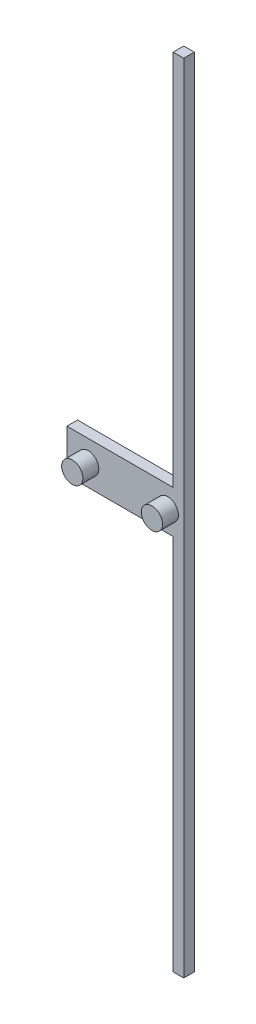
from build123d import *

# Parameters (mm, degrees)
EXTRUSION1_DEPTH = 20
ESQUISSE2_R      = 20
EXTRUSION2_DEPTH = 30


with BuildPart() as part:
    # Esquisse1 → Extrusion1 (new body)
    with BuildSketch(Plane.XY):
        Polygon((200, 0), (200, -710), (220, -710), (220, 790), (200, 790), (200, 80), (0, 80), (0, 0), align=None)
    extrude(amount=EXTRUSION1_DEPTH)

    # Esquisse2 → Extrusion2 (add)
    with BuildSketch(Plane.XY.offset(20)):
        with Locations(Location((40, 40, 0), (0, 0, 180))):
            Circle(ESQUISSE2_R)
        with Locations(Location((190, 40, 0), (0, 0, 180))):
            Circle(ESQUISSE2_R)
    extrude(amount=EXTRUSION2_DEPTH)


solid = part.part
